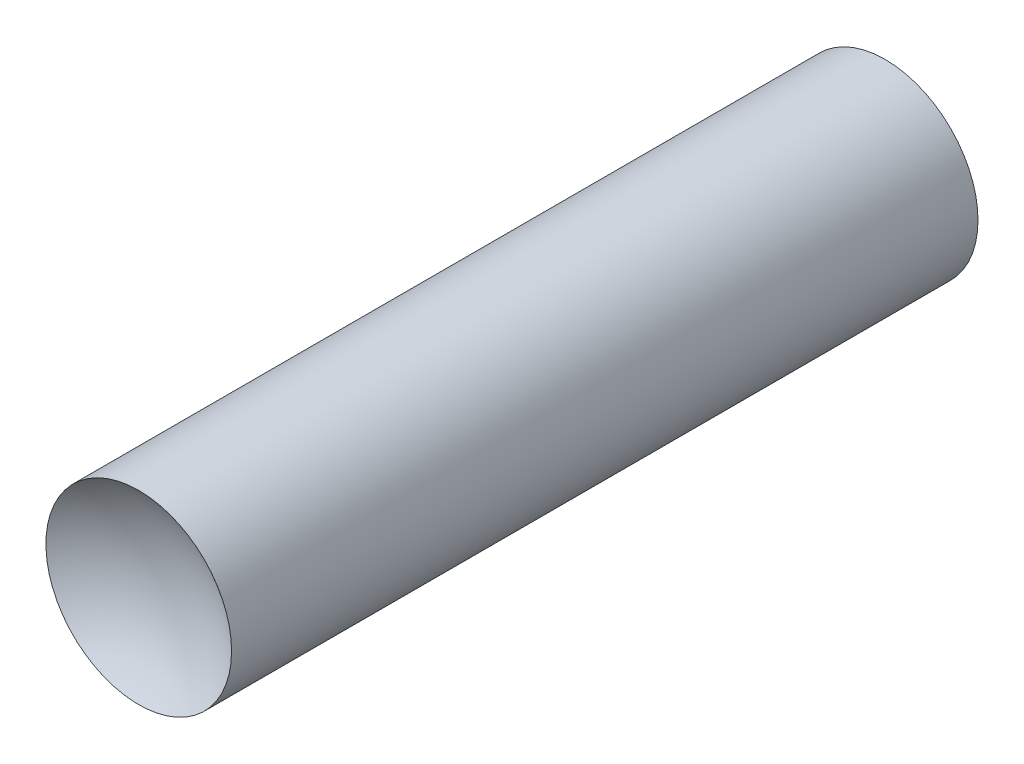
ISO-10303-21;
HEADER;
FILE_DESCRIPTION(('STEP AP214'),'2;1');
FILE_NAME('part.step','',(''),(''),'','','');
FILE_SCHEMA(('AUTOMOTIVE_DESIGN { 1 0 10303 214 1 1 1 1 }'));
ENDSEC;
DATA;
#1=APPLICATION_CONTEXT('core data for automotive mechanical design processes');
#2=APPLICATION_PROTOCOL_DEFINITION('international standard','automotive_design',2000,#1);
#3=PRODUCT_CONTEXT('',#1,'mechanical');
#4=PRODUCT('Part','Part','',(#3));
#5=PRODUCT_RELATED_PRODUCT_CATEGORY('part','',(#4));
#6=PRODUCT_DEFINITION_FORMATION('','',#4);
#7=PRODUCT_DEFINITION_CONTEXT('part definition',#1,'design');
#8=PRODUCT_DEFINITION('design','',#6,#7);
#9=PRODUCT_DEFINITION_SHAPE('','',#8);
#10=(LENGTH_UNIT() NAMED_UNIT(*) SI_UNIT(.MILLI.,.METRE.));
#11=(NAMED_UNIT(*) PLANE_ANGLE_UNIT() SI_UNIT($,.RADIAN.));
#12=(NAMED_UNIT(*) SI_UNIT($,.STERADIAN.) SOLID_ANGLE_UNIT());
#13=UNCERTAINTY_MEASURE_WITH_UNIT(LENGTH_MEASURE(1.E-05),#10,'distance_accuracy_value','');
#14=(GEOMETRIC_REPRESENTATION_CONTEXT(3) GLOBAL_UNCERTAINTY_ASSIGNED_CONTEXT((#13)) GLOBAL_UNIT_ASSIGNED_CONTEXT((#10,
#11,#12)) REPRESENTATION_CONTEXT('',''));
#15=CARTESIAN_POINT('',(0.,0.,0.));
#16=DIRECTION('',(0.,0.,1.));
#17=DIRECTION('',(1.,0.,0.));
#18=AXIS2_PLACEMENT_3D('',#15,#16,#17);
#19=CARTESIAN_POINT('',(0.,0.,6.40631139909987));
#20=DIRECTION('',(0.,0.,1.));
#21=DIRECTION('',(0.,1.,0.));
#22=AXIS2_PLACEMENT_3D('',#19,#20,#21);
#23=SPHERICAL_SURFACE('',#22,1.984375);
#24=CARTESIAN_POINT('',(0.,0.,4.826));
#25=DIRECTION('',(0.,0.,1.));
#26=DIRECTION('',(1.,0.,0.));
#27=AXIS2_PLACEMENT_3D('',#24,#25,#26);
#28=CIRCLE('',#27,1.20015);
#29=CARTESIAN_POINT('',(1.20015,0.,4.826));
#30=VERTEX_POINT('',#29);
#31=EDGE_CURVE('E39',#30,#30,#28,.T.);
#32=ORIENTED_EDGE('',*,*,#31,.T.);
#33=EDGE_LOOP('',(#32));
#34=FACE_BOUND('',#33,.T.);
#35=ADVANCED_FACE('F33',(#34),#23,.F.);
#36=CARTESIAN_POINT('',(0.,0.,-6.40631139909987));
#37=DIRECTION('',(0.,0.,1.));
#38=DIRECTION('',(0.,1.,0.));
#39=AXIS2_PLACEMENT_3D('',#36,#37,#38);
#40=SPHERICAL_SURFACE('',#39,1.984375);
#41=CARTESIAN_POINT('',(0.,0.,-4.826));
#42=DIRECTION('',(0.,0.,1.));
#43=DIRECTION('',(1.,0.,0.));
#44=AXIS2_PLACEMENT_3D('',#41,#42,#43);
#45=CIRCLE('',#44,1.20015);
#46=CARTESIAN_POINT('',(1.20015,0.,-4.826));
#47=VERTEX_POINT('',#46);
#48=EDGE_CURVE('E10',#47,#47,#45,.T.);
#49=ORIENTED_EDGE('',*,*,#48,.F.);
#50=EDGE_LOOP('',(#49));
#51=FACE_BOUND('',#50,.T.);
#52=ADVANCED_FACE('F48',(#51),#40,.F.);
#53=CARTESIAN_POINT('',(0.,0.,38.9221444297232));
#54=DIRECTION('',(0.,0.,1.));
#55=DIRECTION('',(1.,0.,0.));
#56=AXIS2_PLACEMENT_3D('',#53,#54,#55);
#57=CYLINDRICAL_SURFACE('',#56,1.20015);
#58=ORIENTED_EDGE('',*,*,#31,.F.);
#59=EDGE_LOOP('',(#58));
#60=FACE_BOUND('',#59,.T.);
#61=ORIENTED_EDGE('',*,*,#48,.T.);
#62=EDGE_LOOP('',(#61));
#63=FACE_BOUND('',#62,.T.);
#64=ADVANCED_FACE('F46',(#60,#63),#57,.T.);
#65=CLOSED_SHELL('',(#35,#52,#64));
#66=MANIFOLD_SOLID_BREP('B2',#65);
#67=ADVANCED_BREP_SHAPE_REPRESENTATION('',(#18,#66),#14);
#68=SHAPE_DEFINITION_REPRESENTATION(#9,#67);
ENDSEC;
END-ISO-10303-21;
